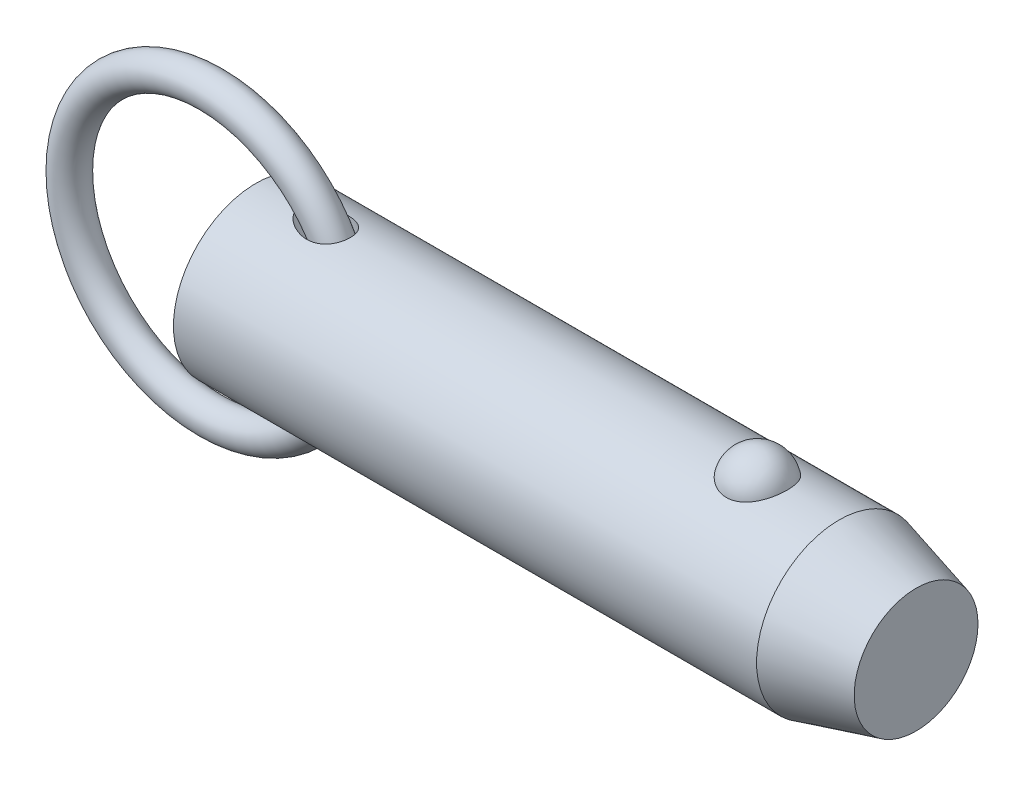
ISO-10303-21;
HEADER;
FILE_DESCRIPTION(('STEP AP214'),'2;1');
FILE_NAME('part.step','',(''),(''),'','','');
FILE_SCHEMA(('AUTOMOTIVE_DESIGN { 1 0 10303 214 1 1 1 1 }'));
ENDSEC;
DATA;
#1=APPLICATION_CONTEXT('core data for automotive mechanical design processes');
#2=APPLICATION_PROTOCOL_DEFINITION('international standard','automotive_design',2000,#1);
#3=PRODUCT_CONTEXT('',#1,'mechanical');
#4=PRODUCT('Part','Part','',(#3));
#5=PRODUCT_RELATED_PRODUCT_CATEGORY('part','',(#4));
#6=PRODUCT_DEFINITION_FORMATION('','',#4);
#7=PRODUCT_DEFINITION_CONTEXT('part definition',#1,'design');
#8=PRODUCT_DEFINITION('design','',#6,#7);
#9=PRODUCT_DEFINITION_SHAPE('','',#8);
#10=(LENGTH_UNIT() NAMED_UNIT(*) SI_UNIT(.MILLI.,.METRE.));
#11=(NAMED_UNIT(*) PLANE_ANGLE_UNIT() SI_UNIT($,.RADIAN.));
#12=(NAMED_UNIT(*) SI_UNIT($,.STERADIAN.) SOLID_ANGLE_UNIT());
#13=UNCERTAINTY_MEASURE_WITH_UNIT(LENGTH_MEASURE(1.E-05),#10,'distance_accuracy_value','');
#14=(GEOMETRIC_REPRESENTATION_CONTEXT(3) GLOBAL_UNCERTAINTY_ASSIGNED_CONTEXT((#13)) GLOBAL_UNIT_ASSIGNED_CONTEXT((#10,
#11,#12)) REPRESENTATION_CONTEXT('',''));
#15=CARTESIAN_POINT('',(0.,0.,0.));
#16=DIRECTION('',(0.,0.,1.));
#17=DIRECTION('',(1.,0.,0.));
#18=AXIS2_PLACEMENT_3D('',#15,#16,#17);
#19=CARTESIAN_POINT('',(-6.08699288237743,0.,0.));
#20=DIRECTION('',(0.,0.,1.));
#21=DIRECTION('',(1.,0.,0.));
#22=AXIS2_PLACEMENT_3D('',#19,#20,#21);
#23=TOROIDAL_SURFACE('',#22,19.05,2.223);
#24=CARTESIAN_POINT('',(15.1860071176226,0.,0.));
#25=VERTEX_POINT('',#24);
#26=VERTEX_LOOP('',#25);
#27=FACE_BOUND('',#26,.T.);
#28=ADVANCED_FACE('P0_F12',(#27),#23,.T.);
#29=CLOSED_SHELL('',(#28));
#30=MANIFOLD_SOLID_BREP('P0_B1',#29);
#31=CARTESIAN_POINT('',(0.,0.,0.));
#32=DIRECTION('',(1.,0.,0.));
#33=DIRECTION('',(0.,0.,-1.));
#34=AXIS2_PLACEMENT_3D('',#31,#32,#33);
#35=CYLINDRICAL_SURFACE('',#34,11.115);
#36=CARTESIAN_POINT('',(6.41405181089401,11.0227946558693,-1.4287136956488));
#37=CARTESIAN_POINT('',(6.49338916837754,11.0115377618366,-1.51556642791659));
#38=CARTESIAN_POINT('',(6.57765461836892,10.9998263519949,-1.59789397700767));
#39=CARTESIAN_POINT('',(6.75386647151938,10.9760304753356,-1.75391400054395));
#40=CARTESIAN_POINT('',(6.84582247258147,10.9639455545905,-1.82759540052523));
#41=CARTESIAN_POINT('',(7.03627827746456,10.9397989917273,-1.96698954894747));
#42=CARTESIAN_POINT('',(7.13480838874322,10.9277377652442,-2.03266078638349));
#43=CARTESIAN_POINT('',(7.33681032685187,10.9041015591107,-2.1558582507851));
#44=CARTESIAN_POINT('',(7.44028007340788,10.8925263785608,-2.21338786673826));
#45=CARTESIAN_POINT('',(7.64386117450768,10.8710104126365,-2.31666528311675));
#46=CARTESIAN_POINT('',(7.74368989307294,10.8610119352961,-2.36295942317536));
#47=CARTESIAN_POINT('',(7.94637195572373,10.8420168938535,-2.44863486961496));
#48=CARTESIAN_POINT('',(8.04922612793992,10.8330206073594,-2.48801426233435));
#49=CARTESIAN_POINT('',(8.36115573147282,10.807980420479,-2.59542730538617));
#50=CARTESIAN_POINT('',(8.57411849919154,10.7938278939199,-2.65299817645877));
#51=CARTESIAN_POINT('',(9.00825016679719,10.7725818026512,-2.73800108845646));
#52=CARTESIAN_POINT('',(9.22947335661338,10.7655491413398,-2.76517330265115));
#53=CARTESIAN_POINT('',(9.67368141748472,10.7605872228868,-2.78445308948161));
#54=CARTESIAN_POINT('',(9.89666486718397,10.7626512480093,-2.77658653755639));
#55=CARTESIAN_POINT('',(10.2950172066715,10.7754452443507,-2.72644436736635));
#56=CARTESIAN_POINT('',(10.4712789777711,10.7844280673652,-2.69109376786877));
#57=CARTESIAN_POINT('',(10.7292776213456,10.8024982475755,-2.61722365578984));
#58=CARTESIAN_POINT('',(10.8142337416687,10.8092901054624,-2.58911576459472));
#59=CARTESIAN_POINT('',(10.9813218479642,10.8242580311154,-2.52581287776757));
#60=CARTESIAN_POINT('',(11.0634550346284,10.8324335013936,-2.49062094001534));
#61=CARTESIAN_POINT('',(11.2247418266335,10.8500287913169,-2.41281958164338));
#62=CARTESIAN_POINT('',(11.3038694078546,10.8594572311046,-2.37015806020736));
#63=CARTESIAN_POINT('',(11.4576781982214,10.8792243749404,-2.27770403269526));
#64=CARTESIAN_POINT('',(11.5323615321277,10.8895626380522,-2.22791497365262));
#65=CARTESIAN_POINT('',(11.6765388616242,10.9108113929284,-2.12140590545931));
#66=CARTESIAN_POINT('',(11.7460329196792,10.9217218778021,-2.06468597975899));
#67=CARTESIAN_POINT('',(11.8790597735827,10.9437207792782,-1.94471764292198));
#68=CARTESIAN_POINT('',(11.9425932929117,10.9548091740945,-1.88147002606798));
#69=CARTESIAN_POINT('',(12.109388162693,10.9851999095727,-1.69784918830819));
#70=CARTESIAN_POINT('',(12.205655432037,11.0042655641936,-1.57093023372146));
#71=CARTESIAN_POINT('',(12.374151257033,11.0393391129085,-1.3017676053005));
#72=CARTESIAN_POINT('',(12.4463875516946,11.0553479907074,-1.15952888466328));
#73=CARTESIAN_POINT('',(12.5615818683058,11.0816338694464,-0.871972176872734));
#74=CARTESIAN_POINT('',(12.6058896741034,11.0921698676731,-0.727217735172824));
#75=CARTESIAN_POINT('',(12.6699315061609,11.1075802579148,-0.432089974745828));
#76=CARTESIAN_POINT('',(12.6896681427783,11.1124552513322,-0.281717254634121));
#77=CARTESIAN_POINT('',(12.7040225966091,11.1159901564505,0.0188164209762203));
#78=CARTESIAN_POINT('',(12.6988836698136,11.1147102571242,0.168965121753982));
#79=CARTESIAN_POINT('',(12.6641681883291,11.1062126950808,0.466238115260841));
#80=CARTESIAN_POINT('',(12.6345920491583,11.0989951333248,0.61336245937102));
#81=CARTESIAN_POINT('',(12.5517453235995,11.0794095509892,0.900330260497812));
#82=CARTESIAN_POINT('',(12.4984878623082,11.0670443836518,1.0401777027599));
#83=CARTESIAN_POINT('',(12.3696588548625,11.0385082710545,1.308745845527));
#84=CARTESIAN_POINT('',(12.2940887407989,11.0223375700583,1.43746725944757));
#85=CARTESIAN_POINT('',(12.122380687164,10.987872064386,1.68079704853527));
#86=CARTESIAN_POINT('',(12.0261637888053,10.969569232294,1.79534850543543));
#87=CARTESIAN_POINT('',(11.8161707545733,10.932836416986,2.00695695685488));
#88=CARTESIAN_POINT('',(11.7023941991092,10.9144064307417,2.10401353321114));
#89=CARTESIAN_POINT('',(11.4575656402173,10.8788057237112,2.28105326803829));
#90=CARTESIAN_POINT('',(11.3261451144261,10.8616794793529,2.36053412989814));
#91=CARTESIAN_POINT('',(11.0523589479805,10.8308019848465,2.49839044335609));
#92=CARTESIAN_POINT('',(10.9099908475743,10.8170514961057,2.55676113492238));
#93=CARTESIAN_POINT('',(10.6060622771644,10.7929728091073,2.65666105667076));
#94=CARTESIAN_POINT('',(10.4438877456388,10.7830209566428,2.69640163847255));
#95=CARTESIAN_POINT('',(10.1154037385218,10.7687230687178,2.75293129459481));
#96=CARTESIAN_POINT('',(9.94909141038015,10.7643810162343,2.76970406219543));
#97=CARTESIAN_POINT('',(9.54387061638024,10.7604809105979,2.7848723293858));
#98=CARTESIAN_POINT('',(9.30446860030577,10.7637793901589,2.77227753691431));
#99=CARTESIAN_POINT('',(8.94961255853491,10.7757341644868,2.72524141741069));
#100=CARTESIAN_POINT('',(8.83186896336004,10.7808994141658,2.70482239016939));
#101=CARTESIAN_POINT('',(8.59835142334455,10.7932548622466,2.6550999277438));
#102=CARTESIAN_POINT('',(8.48257728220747,10.8004448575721,2.62579738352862));
#103=CARTESIAN_POINT('',(8.25208469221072,10.8166382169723,2.55827624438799));
#104=CARTESIAN_POINT('',(8.13740214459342,10.8256649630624,2.51994155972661));
#105=CARTESIAN_POINT('',(7.91132058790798,10.8451170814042,2.43486475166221));
#106=CARTESIAN_POINT('',(7.79992154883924,10.8555424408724,2.38812270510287));
#107=CARTESIAN_POINT('',(7.58115677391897,10.8774251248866,2.28638483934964));
#108=CARTESIAN_POINT('',(7.47378802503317,10.8888816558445,2.23139534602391));
#109=CARTESIAN_POINT('',(7.26385624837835,10.9124540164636,2.1131026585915));
#110=CARTESIAN_POINT('',(7.1612916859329,10.9245696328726,2.04980214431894));
#111=CARTESIAN_POINT('',(6.91882218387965,10.9543689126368,1.88540538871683));
#112=CARTESIAN_POINT('',(6.78193778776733,10.9721958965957,1.77979827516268));
#113=CARTESIAN_POINT('',(6.5247244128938,11.0070222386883,1.54989693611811));
#114=CARTESIAN_POINT('',(6.40436902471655,11.0240228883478,1.42563320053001));
#115=CARTESIAN_POINT('',(6.21838804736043,11.0509658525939,1.19529359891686));
#116=CARTESIAN_POINT('',(6.14691885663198,11.0615430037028,1.09404520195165));
#117=CARTESIAN_POINT('',(6.02043496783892,11.0805004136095,0.881508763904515));
#118=CARTESIAN_POINT('',(5.96539400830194,11.0888841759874,0.770237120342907));
#119=CARTESIAN_POINT('',(5.88475453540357,11.1012553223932,0.560577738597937));
#120=CARTESIAN_POINT('',(5.85559643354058,11.1057686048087,0.463603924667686));
#121=CARTESIAN_POINT('',(5.81381299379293,11.1122523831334,0.266083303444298));
#122=CARTESIAN_POINT('',(5.80117118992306,11.1142254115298,0.165540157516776));
#123=CARTESIAN_POINT('',(5.79363815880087,11.1153999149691,-0.0364747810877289));
#124=CARTESIAN_POINT('',(5.79878799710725,11.1145949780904,-0.137948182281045));
#125=CARTESIAN_POINT('',(5.82639592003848,11.1102987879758,-0.338493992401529));
#126=CARTESIAN_POINT('',(5.84887234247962,11.1068046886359,-0.43756374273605));
#127=CARTESIAN_POINT('',(5.91510741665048,11.0965857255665,-0.649968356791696));
#128=CARTESIAN_POINT('',(5.96220905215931,11.0893566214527,-0.762222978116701));
#129=CARTESIAN_POINT('',(6.07378449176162,11.072471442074,-0.977396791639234));
#130=CARTESIAN_POINT('',(6.13826787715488,11.0628140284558,-1.08031079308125));
#131=CARTESIAN_POINT('',(6.2410107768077,11.0477136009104,-1.2219580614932));
#132=CARTESIAN_POINT('',(6.27403486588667,11.042895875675,-1.26469183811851));
#133=CARTESIAN_POINT('',(6.34238022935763,11.0330152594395,-1.34817011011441));
#134=CARTESIAN_POINT('',(6.37769867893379,11.0279526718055,-1.38891694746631));
#135=CARTESIAN_POINT('',(6.41405181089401,11.0227946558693,-1.4287136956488));
#136=B_SPLINE_CURVE_WITH_KNOTS('',3,(#36,#37,#38,#39,#40,#41,#42,#43,#44,#45,#46,#47,#48,#49,
#50,#51,#52,#53,#54,#55,#56,#57,#58,#59,#60,#61,#62,#63,#64,#65,#66,#67,#68,#69,#70,#71,#72,#73,
#74,#75,#76,#77,#78,#79,#80,#81,#82,#83,#84,#85,#86,#87,#88,#89,#90,#91,#92,#93,#94,#95,#96,#97,
#98,#99,#100,#101,#102,#103,#104,#105,#106,#107,#108,#109,#110,#111,#112,#113,#114,#115,#116,
#117,#118,#119,#120,#121,#122,#123,#124,#125,#126,#127,#128,#129,#130,#131,#132,#133,#134,#135),
.UNSPECIFIED.,.T.,.F.,(4,2,2,2,2,2,2,2,2,2,2,2,2,2,2,2,2,2,2,2,2,2,2,2,2,2,2,2,2,2,2,2,2,2,2,2,
2,2,2,2,2,2,2,2,2,2,2,2,2,4),(0.,0.35443329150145,0.709315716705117,1.0659654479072,
1.42246628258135,1.7536715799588,2.08496839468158,2.74582009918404,3.41227815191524,
4.07824412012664,4.61583787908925,4.88478112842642,5.1536085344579,5.42439170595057,
5.69504436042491,5.96569375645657,6.23631025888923,6.71490729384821,7.19335005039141,
7.64641437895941,8.09943057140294,8.54802575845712,8.99661331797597,9.44495256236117,
9.89326303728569,10.3433195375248,10.7933867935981,11.2550086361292,11.7167345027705,
12.2165866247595,12.7167934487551,13.4318876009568,13.7904664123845,14.1490092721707,
14.5124394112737,14.8758662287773,15.239015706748,15.6020483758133,16.1219860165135,
16.6410830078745,17.0130520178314,17.3844231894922,17.6872330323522,17.9897407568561,
18.2929471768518,18.5964749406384,18.9603532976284,19.3244326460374,19.4870338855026,
19.649438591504),.UNSPECIFIED.);
#137=CARTESIAN_POINT('',(6.41405181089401,11.0227946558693,-1.4287136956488));
#138=VERTEX_POINT('',#137);
#139=EDGE_CURVE('P1_E40',#138,#138,#136,.T.);
#140=ORIENTED_EDGE('',*,*,#139,.T.);
#141=EDGE_LOOP('',(#140));
#142=FACE_BOUND('',#141,.T.);
#143=CARTESIAN_POINT('',(78.529563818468,0.,0.));
#144=DIRECTION('',(1.,0.,0.));
#145=DIRECTION('',(0.,0.,-1.));
#146=AXIS2_PLACEMENT_3D('',#143,#144,#145);
#147=CIRCLE('',#146,11.115);
#148=CARTESIAN_POINT('',(78.529563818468,0.,-11.115));
#149=VERTEX_POINT('',#148);
#150=EDGE_CURVE('P1_E25',#149,#149,#147,.T.);
#151=ORIENTED_EDGE('',*,*,#150,.F.);
#152=EDGE_LOOP('',(#151));
#153=FACE_BOUND('',#152,.T.);
#154=CARTESIAN_POINT('',(0.,0.,0.));
#155=DIRECTION('',(1.,0.,0.));
#156=DIRECTION('',(0.,0.,-1.));
#157=AXIS2_PLACEMENT_3D('',#154,#155,#156);
#158=CIRCLE('',#157,11.115);
#159=CARTESIAN_POINT('',(0.,0.,-11.115));
#160=VERTEX_POINT('',#159);
#161=EDGE_CURVE('P1_E9',#160,#160,#158,.T.);
#162=ORIENTED_EDGE('',*,*,#161,.T.);
#163=EDGE_LOOP('',(#162));
#164=FACE_BOUND('',#163,.T.);
#165=CARTESIAN_POINT('',(67.5310680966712,10.3028087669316,4.17077409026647));
#166=CARTESIAN_POINT('',(67.3147756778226,10.3028003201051,4.17078240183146));
#167=CARTESIAN_POINT('',(67.0985488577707,10.3098895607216,4.15340593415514));
#168=CARTESIAN_POINT('',(66.6725408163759,10.3373834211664,4.08449540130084));
#169=CARTESIAN_POINT('',(66.4627577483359,10.3577841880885,4.03297121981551));
#170=CARTESIAN_POINT('',(66.0557825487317,10.4095237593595,3.89746513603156));
#171=CARTESIAN_POINT('',(65.8585726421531,10.4408466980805,3.81353029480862));
#172=CARTESIAN_POINT('',(65.4813382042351,10.5110236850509,3.61560339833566));
#173=CARTESIAN_POINT('',(65.3013171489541,10.5498792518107,3.50160528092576));
#174=CARTESIAN_POINT('',(64.9576842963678,10.6322884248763,3.24292464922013));
#175=CARTESIAN_POINT('',(64.7946861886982,10.6759443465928,3.09746040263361));
#176=CARTESIAN_POINT('',(64.4945911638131,10.7625291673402,2.78171925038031));
#177=CARTESIAN_POINT('',(64.3574990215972,10.8054579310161,2.61143778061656));
#178=CARTESIAN_POINT('',(64.1064084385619,10.8881935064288,2.24226695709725));
#179=CARTESIAN_POINT('',(63.9937105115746,10.9277761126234,2.04244123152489));
#180=CARTESIAN_POINT('',(63.8017771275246,10.997484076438,1.62578254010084));
#181=CARTESIAN_POINT('',(63.722544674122,11.0276085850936,1.40894804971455));
#182=CARTESIAN_POINT('',(63.5983034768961,11.0756732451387,0.961250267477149));
#183=CARTESIAN_POINT('',(63.553760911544,11.0934470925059,0.730239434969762));
#184=CARTESIAN_POINT('',(63.5015695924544,11.1143331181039,0.263439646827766));
#185=CARTESIAN_POINT('',(63.4939200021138,11.1174456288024,0.0276507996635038));
#186=CARTESIAN_POINT('',(63.5156105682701,11.1087161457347,-0.440729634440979));
#187=CARTESIAN_POINT('',(63.5447624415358,11.0969502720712,-0.673331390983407));
#188=CARTESIAN_POINT('',(63.6391432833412,11.0597872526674,-1.12996621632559));
#189=CARTESIAN_POINT('',(63.7043729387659,11.0343898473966,-1.35399912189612));
#190=CARTESIAN_POINT('',(63.8696984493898,10.972515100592,-1.78750286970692));
#191=CARTESIAN_POINT('',(63.9698386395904,10.9360236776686,-1.99695478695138));
#192=CARTESIAN_POINT('',(64.2029408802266,10.8557595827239,-2.39520667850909));
#193=CARTESIAN_POINT('',(64.3359054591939,10.8119863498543,-2.5840050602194));
#194=CARTESIAN_POINT('',(64.632407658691,10.7216733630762,-2.93635726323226));
#195=CARTESIAN_POINT('',(64.7960565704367,10.675123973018,-3.09981510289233));
#196=CARTESIAN_POINT('',(65.1498601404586,10.5846571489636,-3.39592247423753));
#197=CARTESIAN_POINT('',(65.3400123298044,10.5407394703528,-3.52857487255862));
#198=CARTESIAN_POINT('',(65.7375014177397,10.4616690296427,-3.75646057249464));
#199=CARTESIAN_POINT('',(65.9443670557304,10.4263443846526,-3.85245432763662));
#200=CARTESIAN_POINT('',(66.3729541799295,10.3675574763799,-4.0079874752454));
#201=CARTESIAN_POINT('',(66.594670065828,10.3440907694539,-4.06754052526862));
#202=CARTESIAN_POINT('',(67.0346695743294,10.3128282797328,-4.14614314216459));
#203=CARTESIAN_POINT('',(67.2525654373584,10.3043040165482,-4.16707833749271));
#204=CARTESIAN_POINT('',(67.68894951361,10.3016771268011,-4.17357158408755));
#205=CARTESIAN_POINT('',(67.9074376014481,10.3075716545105,-4.15913661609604));
#206=CARTESIAN_POINT('',(68.3317442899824,10.3326686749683,-4.09636961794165));
#207=CARTESIAN_POINT('',(68.5377458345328,10.3514555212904,-4.04909574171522));
#208=CARTESIAN_POINT('',(68.9385764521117,10.3998183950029,-3.92320197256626));
#209=CARTESIAN_POINT('',(69.1334046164,10.4293952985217,-3.84457953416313));
#210=CARTESIAN_POINT('',(69.5111917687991,10.4969600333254,-3.65612410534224));
#211=CARTESIAN_POINT('',(69.6937974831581,10.5351178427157,-3.5456454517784));
#212=CARTESIAN_POINT('',(70.0382040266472,10.6154999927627,-3.29718036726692));
#213=CARTESIAN_POINT('',(70.200000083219,10.657725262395,-3.15918764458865));
#214=CARTESIAN_POINT('',(70.5069596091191,10.744212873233,-2.85163580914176));
#215=CARTESIAN_POINT('',(70.6508919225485,10.7884718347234,-2.68084605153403));
#216=CARTESIAN_POINT('',(70.9092371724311,10.872374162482,-2.31721864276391));
#217=CARTESIAN_POINT('',(71.0236448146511,10.9120167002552,-2.12437704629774));
#218=CARTESIAN_POINT('',(71.2238739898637,10.9838919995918,-1.71516999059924));
#219=CARTESIAN_POINT('',(71.3086617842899,11.0158465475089,-1.49824866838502));
#220=CARTESIAN_POINT('',(71.4426838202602,11.0673523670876,-1.05228572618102));
#221=CARTESIAN_POINT('',(71.4919174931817,11.086903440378,-0.823243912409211));
#222=CARTESIAN_POINT('',(71.5538915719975,11.1116323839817,-0.359087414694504));
#223=CARTESIAN_POINT('',(71.5665662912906,11.1167843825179,-0.123962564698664));
#224=CARTESIAN_POINT('',(71.554973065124,11.1121144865,0.345220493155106));
#225=CARTESIAN_POINT('',(71.5307056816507,11.1022928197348,0.579278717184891));
#226=CARTESIAN_POINT('',(71.4459073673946,11.0687504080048,1.03866534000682));
#227=CARTESIAN_POINT('',(71.3855299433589,11.0450885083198,1.26402641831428));
#228=CARTESIAN_POINT('',(71.2298532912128,10.9863185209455,1.70076772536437));
#229=CARTESIAN_POINT('',(71.134551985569,10.9512097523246,1.91214712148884));
#230=CARTESIAN_POINT('',(70.9103974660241,10.8729733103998,2.316083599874));
#231=CARTESIAN_POINT('',(70.7813806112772,10.8298068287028,2.50854240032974));
#232=CARTESIAN_POINT('',(70.4927327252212,10.7401896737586,2.86808766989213));
#233=CARTESIAN_POINT('',(70.3331022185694,10.6937390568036,3.03517457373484));
#234=CARTESIAN_POINT('',(69.9875341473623,10.6029321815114,3.33857581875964));
#235=CARTESIAN_POINT('',(69.8017089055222,10.5585680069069,3.47501541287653));
#236=CARTESIAN_POINT('',(69.4078750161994,10.4769321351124,3.71390897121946));
#237=CARTESIAN_POINT('',(69.1998635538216,10.439661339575,3.81635861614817));
#238=CARTESIAN_POINT('',(68.7540666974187,10.3749407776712,3.98910631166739));
#239=CARTESIAN_POINT('',(68.5152342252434,10.3482457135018,4.05700929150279));
#240=CARTESIAN_POINT('',(68.0279254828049,10.312188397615,4.14782844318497));
#241=CARTESIAN_POINT('',(67.7794535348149,10.3028184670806,4.17076454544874));
#242=CARTESIAN_POINT('',(67.5310680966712,10.3028087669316,4.17077409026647));
#243=B_SPLINE_CURVE_WITH_KNOTS('',3,(#165,#166,#167,#168,#169,#170,#171,#172,#173,#174,#175,
#176,#177,#178,#179,#180,#181,#182,#183,#184,#185,#186,#187,#188,#189,#190,#191,#192,#193,#194,
#195,#196,#197,#198,#199,#200,#201,#202,#203,#204,#205,#206,#207,#208,#209,#210,#211,#212,#213,
#214,#215,#216,#217,#218,#219,#220,#221,#222,#223,#224,#225,#226,#227,#228,#229,#230,#231,#232,
#233,#234,#235,#236,#237,#238,#239,#240,#241,#242),.UNSPECIFIED.,.T.,.F.,(4,2,2,2,2,2,2,2,2,2,2,
2,2,2,2,2,2,2,2,2,2,2,2,2,2,2,2,2,2,2,2,2,2,2,2,2,2,2,4),(0.,0.647966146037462,1.29574482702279,
1.94258643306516,2.58955857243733,3.25496465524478,3.92049326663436,4.61566368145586,
5.31089647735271,6.0153182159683,6.71972398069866,7.42054043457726,8.12137023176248,
8.82309331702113,9.52487047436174,10.2292439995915,10.9335519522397,11.622333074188,
12.3108558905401,12.9647664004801,13.6185478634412,14.2521847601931,14.8858731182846,
15.5334360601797,16.1811472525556,16.8611459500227,17.5412664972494,18.2431855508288,
18.9451158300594,19.6483065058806,20.3514864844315,21.0516982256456,21.7519516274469,
22.4556690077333,23.1593743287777,23.8601491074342,24.5610129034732,25.3054529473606,
26.0495629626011),.UNSPECIFIED.);
#244=CARTESIAN_POINT('',(67.5310680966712,10.3028087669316,4.17077409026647));
#245=VERTEX_POINT('',#244);
#246=EDGE_CURVE('P1_E34',#245,#245,#243,.T.);
#247=ORIENTED_EDGE('',*,*,#246,.T.);
#248=EDGE_LOOP('',(#247));
#249=FACE_BOUND('',#248,.T.);
#250=CARTESIAN_POINT('',(6.41405181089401,-11.0227946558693,-1.4287136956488));
#251=CARTESIAN_POINT('',(6.33124061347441,-11.0345445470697,-1.33806125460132));
#252=CARTESIAN_POINT('',(6.25372866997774,-11.0458090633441,-1.24240732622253));
#253=CARTESIAN_POINT('',(6.11277905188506,-11.0666115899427,-1.04095704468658));
#254=CARTESIAN_POINT('',(6.0493392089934,-11.0761498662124,-0.935162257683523));
#255=CARTESIAN_POINT('',(5.94029181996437,-11.0927063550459,-0.712476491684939));
#256=CARTESIAN_POINT('',(5.89492964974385,-11.0996897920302,-0.595457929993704));
#257=CARTESIAN_POINT('',(5.8449816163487,-11.1074141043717,-0.414997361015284));
#258=CARTESIAN_POINT('',(5.83135004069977,-11.1095300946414,-0.354047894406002));
#259=CARTESIAN_POINT('',(5.81051649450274,-11.1127688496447,-0.231041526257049));
#260=CARTESIAN_POINT('',(5.80331311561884,-11.1138918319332,-0.1689848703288));
#261=CARTESIAN_POINT('',(5.79296529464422,-11.1155042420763,-0.00048481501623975));
#262=CARTESIAN_POINT('',(5.79625267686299,-11.1149904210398,0.106437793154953));
#263=CARTESIAN_POINT('',(5.82213676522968,-11.1109609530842,0.317809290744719));
#264=CARTESIAN_POINT('',(5.84474662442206,-11.1074432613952,0.422256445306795));
#265=CARTESIAN_POINT('',(5.91113114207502,-11.097197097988,0.63936180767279));
#266=CARTESIAN_POINT('',(5.95733120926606,-11.090102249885,0.751250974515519));
#267=CARTESIAN_POINT('',(6.0670954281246,-11.0734770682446,0.965912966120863));
#268=CARTESIAN_POINT('',(6.1306873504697,-11.06394284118,1.06867085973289));
#269=CARTESIAN_POINT('',(6.30294237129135,-11.0385920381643,1.30890635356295));
#270=CARTESIAN_POINT('',(6.41896200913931,-11.0218881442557,1.44097376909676));
#271=CARTESIAN_POINT('',(6.66989654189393,-10.9871512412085,1.68553954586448));
#272=CARTESIAN_POINT('',(6.80485520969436,-10.9691152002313,1.79799117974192));
#273=CARTESIAN_POINT('',(7.04881236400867,-10.9382283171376,1.97587596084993));
#274=CARTESIAN_POINT('',(7.15465712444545,-10.9253240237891,2.04570822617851));
#275=CARTESIAN_POINT('',(7.37202504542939,-10.9000987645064,2.17611840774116));
#276=CARTESIAN_POINT('',(7.48355057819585,-10.8877780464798,2.23669241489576));
#277=CARTESIAN_POINT('',(7.71132418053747,-10.8641580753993,2.34873831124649));
#278=CARTESIAN_POINT('',(7.82757727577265,-10.8528599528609,2.40020018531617));
#279=CARTESIAN_POINT('',(8.06386825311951,-10.8317234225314,2.49385169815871));
#280=CARTESIAN_POINT('',(8.18390558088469,-10.8218848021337,2.53604268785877));
#281=CARTESIAN_POINT('',(8.42918336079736,-10.8039208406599,2.61152283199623));
#282=CARTESIAN_POINT('',(8.55447802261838,-10.7958283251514,2.64464414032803));
#283=CARTESIAN_POINT('',(8.80752127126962,-10.781995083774,2.70048793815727));
#284=CARTESIAN_POINT('',(8.9352701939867,-10.7762546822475,2.72320899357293));
#285=CARTESIAN_POINT('',(9.19210176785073,-10.7675291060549,2.75750994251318));
#286=CARTESIAN_POINT('',(9.32118105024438,-10.7645381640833,2.76911315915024));
#287=CARTESIAN_POINT('',(9.57984338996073,-10.761622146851,2.78042035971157));
#288=CARTESIAN_POINT('',(9.70942621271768,-10.7616957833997,2.78012934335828));
#289=CARTESIAN_POINT('',(10.0243125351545,-10.7659059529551,2.76381534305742));
#290=CARTESIAN_POINT('',(10.209307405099,-10.7717977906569,2.74099674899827));
#291=CARTESIAN_POINT('',(10.5731188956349,-10.7905408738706,2.66626238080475));
#292=CARTESIAN_POINT('',(10.7519389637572,-10.8033881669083,2.61436313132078));
#293=CARTESIAN_POINT('',(11.0114289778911,-10.8271584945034,2.51336808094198));
#294=CARTESIAN_POINT('',(11.0968318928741,-10.835881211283,2.47562331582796));
#295=CARTESIAN_POINT('',(11.2636000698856,-10.8545688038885,2.39236170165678));
#296=CARTESIAN_POINT('',(11.344967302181,-10.8645330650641,2.3468486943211));
#297=CARTESIAN_POINT('',(11.5027832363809,-10.8853818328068,2.24815967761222));
#298=CARTESIAN_POINT('',(11.5792327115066,-10.8962661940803,2.19498487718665));
#299=CARTESIAN_POINT('',(11.7263315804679,-10.9185541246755,2.08128855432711));
#300=CARTESIAN_POINT('',(11.7969818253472,-10.9299576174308,2.02076811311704));
#301=CARTESIAN_POINT('',(11.9817953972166,-10.9613645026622,1.84513663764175));
#302=CARTESIAN_POINT('',(12.0893012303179,-10.9814643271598,1.72286660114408));
#303=CARTESIAN_POINT('',(12.2803576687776,-11.0193991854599,1.46066991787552));
#304=CARTESIAN_POINT('',(12.3639173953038,-11.0372350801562,1.32075002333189));
#305=CARTESIAN_POINT('',(12.4996220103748,-11.0672969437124,1.03778067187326));
#306=CARTESIAN_POINT('',(12.5535315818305,-11.0798242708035,0.895607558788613));
#307=CARTESIAN_POINT('',(12.636874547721,-11.0995427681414,0.603918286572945));
#308=CARTESIAN_POINT('',(12.6663115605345,-11.1067347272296,0.454403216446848));
#309=CARTESIAN_POINT('',(12.6997387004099,-11.1149224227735,0.154577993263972));
#310=CARTESIAN_POINT('',(12.7040886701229,-11.1160057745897,0.00431019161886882));
#311=CARTESIAN_POINT('',(12.6882048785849,-11.1120956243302,-0.294841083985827));
#312=CARTESIAN_POINT('',(12.6679715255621,-11.1071022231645,-0.44372458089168));
#313=CARTESIAN_POINT('',(12.6034470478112,-11.0915888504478,-0.735688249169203));
#314=CARTESIAN_POINT('',(12.5591858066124,-11.0810757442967,-0.878775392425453));
#315=CARTESIAN_POINT('',(12.4477416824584,-11.0556687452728,-1.15529525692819));
#316=CARTESIAN_POINT('',(12.3805601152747,-11.0407751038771,-1.2887285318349));
#317=CARTESIAN_POINT('',(12.2248919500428,-11.0081839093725,-1.54257976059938));
#318=CARTESIAN_POINT('',(12.1363549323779,-10.9904797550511,-1.66296592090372));
#319=CARTESIAN_POINT('',(11.9406137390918,-10.9541951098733,-1.88726577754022));
#320=CARTESIAN_POINT('',(11.833409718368,-10.9356146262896,-1.99117961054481));
#321=CARTESIAN_POINT('',(11.601318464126,-10.8991360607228,-2.18213646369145));
#322=CARTESIAN_POINT('',(11.4761325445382,-10.8812577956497,-2.26881927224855));
#323=CARTESIAN_POINT('',(11.2134852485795,-10.8482871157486,-2.42157282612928));
#324=CARTESIAN_POINT('',(11.0760218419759,-10.8331951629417,-2.48764015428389));
#325=CARTESIAN_POINT('',(10.7828968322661,-10.8061050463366,-2.60290068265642));
#326=CARTESIAN_POINT('',(10.6266338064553,-10.7943907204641,-2.65062248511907));
#327=CARTESIAN_POINT('',(10.3086617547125,-10.7762429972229,-2.72345054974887));
#328=CARTESIAN_POINT('',(10.146948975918,-10.7698133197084,-2.74854088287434));
#329=CARTESIAN_POINT('',(9.75541304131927,-10.7608036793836,-2.78368719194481));
#330=CARTESIAN_POINT('',(9.52459435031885,-10.7608467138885,-2.78350276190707));
#331=CARTESIAN_POINT('',(9.06604960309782,-10.7702674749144,-2.74677945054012));
#332=CARTESIAN_POINT('',(8.83832966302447,-10.7796615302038,-2.71017697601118));
#333=CARTESIAN_POINT('',(8.38783466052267,-10.8058248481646,-2.60392490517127));
#334=CARTESIAN_POINT('',(8.1651710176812,-10.8226939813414,-2.53382676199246));
#335=CARTESIAN_POINT('',(7.84087311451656,-10.8516548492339,-2.40555545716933));
#336=CARTESIAN_POINT('',(7.73435551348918,-10.8619221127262,-2.35892455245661));
#337=CARTESIAN_POINT('',(7.52510420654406,-10.883357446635,-2.25797017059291));
#338=CARTESIAN_POINT('',(7.4223698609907,-10.8945253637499,-2.20364800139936));
#339=CARTESIAN_POINT('',(7.23808758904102,-10.915528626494,-2.09688018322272));
#340=CARTESIAN_POINT('',(7.15584631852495,-10.9252787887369,-2.0456107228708));
#341=CARTESIAN_POINT('',(6.99510576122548,-10.944960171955,-1.93754729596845));
#342=CARTESIAN_POINT('',(6.91660574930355,-10.9548913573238,-1.88075440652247));
#343=CARTESIAN_POINT('',(6.76418133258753,-10.974690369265,-1.76154504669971));
#344=CARTESIAN_POINT('',(6.69024940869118,-10.9845582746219,-1.6991382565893));
#345=CARTESIAN_POINT('',(6.54780119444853,-11.0039826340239,-1.56842485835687));
#346=CARTESIAN_POINT('',(6.47928247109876,-11.0135392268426,-1.50012092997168));
#347=CARTESIAN_POINT('',(6.41405181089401,-11.0227946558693,-1.4287136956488));
#348=B_SPLINE_CURVE_WITH_KNOTS('',3,(#250,#251,#252,#253,#254,#255,#256,#257,#258,#259,#260,
#261,#262,#263,#264,#265,#266,#267,#268,#269,#270,#271,#272,#273,#274,#275,#276,#277,#278,#279,
#280,#281,#282,#283,#284,#285,#286,#287,#288,#289,#290,#291,#292,#293,#294,#295,#296,#297,#298,
#299,#300,#301,#302,#303,#304,#305,#306,#307,#308,#309,#310,#311,#312,#313,#314,#315,#316,#317,
#318,#319,#320,#321,#322,#323,#324,#325,#326,#327,#328,#329,#330,#331,#332,#333,#334,#335,#336,
#337,#338,#339,#340,#341,#342,#343,#344,#345,#346,#347),.UNSPECIFIED.,.T.,.F.,(4,2,2,2,2,2,2,2,
2,2,2,2,2,2,2,2,2,2,2,2,2,2,2,2,2,2,2,2,2,2,2,2,2,2,2,2,2,2,2,2,2,2,2,2,2,2,2,2,4),(0.,
0.36983565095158,0.739614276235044,1.1142538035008,1.30141910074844,1.48854338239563,
1.8074587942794,2.12659146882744,2.4883888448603,2.85076733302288,3.3776216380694,
3.90571433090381,4.287639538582,4.66972556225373,5.05222896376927,5.43467659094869,
5.82378546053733,6.21294796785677,6.6012922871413,6.98947336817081,7.54669558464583,
8.10360148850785,8.3845853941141,8.66543074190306,8.94623182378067,9.22699162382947,
9.7162888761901,10.2053995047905,10.6608871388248,11.1163074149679,11.5651786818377,
12.0140424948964,12.4623493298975,12.9106304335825,13.3599804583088,13.8093267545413,
14.2672570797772,14.7252632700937,15.214740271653,15.7045615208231,16.3932594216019,
17.083162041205,17.7825738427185,18.1325177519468,18.4824022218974,18.7744056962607,
19.0663523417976,19.3578048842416,19.6491256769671),.UNSPECIFIED.);
#349=CARTESIAN_POINT('',(6.41405181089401,-11.0227946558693,-1.4287136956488));
#350=VERTEX_POINT('',#349);
#351=EDGE_CURVE('P1_E17',#350,#350,#348,.T.);
#352=ORIENTED_EDGE('',*,*,#351,.T.);
#353=EDGE_LOOP('',(#352));
#354=FACE_BOUND('',#353,.T.);
#355=ADVANCED_FACE('P1_F13',(#142,#153,#164,#249,#354),#35,.T.);
#356=CARTESIAN_POINT('',(0.,0.,0.));
#357=DIRECTION('',(-1.,0.,0.));
#358=DIRECTION('',(0.,0.,1.));
#359=AXIS2_PLACEMENT_3D('',#356,#357,#358);
#360=PLANE('',#359);
#361=ORIENTED_EDGE('',*,*,#161,.F.);
#362=EDGE_LOOP('',(#361));
#363=FACE_BOUND('',#362,.T.);
#364=ADVANCED_FACE('P1_F15',(#363),#360,.T.);
#365=CARTESIAN_POINT('',(88.9,0.,0.));
#366=DIRECTION('',(-1.,0.,0.));
#367=DIRECTION('',(0.,0.,1.));
#368=AXIS2_PLACEMENT_3D('',#365,#366,#367);
#369=CONICAL_SURFACE('',#368,8.33625000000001,0.26179938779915);
#370=ORIENTED_EDGE('',*,*,#150,.T.);
#371=EDGE_LOOP('',(#370));
#372=FACE_BOUND('',#371,.T.);
#373=CARTESIAN_POINT('',(88.9,0.,0.));
#374=DIRECTION('',(1.,0.,0.));
#375=DIRECTION('',(0.,0.,-1.));
#376=AXIS2_PLACEMENT_3D('',#373,#374,#375);
#377=CIRCLE('',#376,8.33625000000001);
#378=CARTESIAN_POINT('',(88.9,0.,-8.33625000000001));
#379=VERTEX_POINT('',#378);
#380=EDGE_CURVE('P1_E30',#379,#379,#377,.T.);
#381=ORIENTED_EDGE('',*,*,#380,.F.);
#382=EDGE_LOOP('',(#381));
#383=FACE_BOUND('',#382,.T.);
#384=ADVANCED_FACE('P1_F55',(#372,#383),#369,.T.);
#385=CARTESIAN_POINT('',(88.9,8.33625000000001,0.));
#386=DIRECTION('',(1.,0.,0.));
#387=DIRECTION('',(0.,0.,-1.));
#388=AXIS2_PLACEMENT_3D('',#385,#386,#387);
#389=PLANE('',#388);
#390=ORIENTED_EDGE('',*,*,#380,.T.);
#391=EDGE_LOOP('',(#390));
#392=FACE_BOUND('',#391,.T.);
#393=ADVANCED_FACE('P1_F51',(#392),#389,.T.);
#394=CARTESIAN_POINT('',(67.5310680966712,10.0035,0.));
#395=DIRECTION('',(-1.,0.,0.));
#396=DIRECTION('',(0.,1.,0.));
#397=AXIS2_PLACEMENT_3D('',#394,#395,#396);
#398=SPHERICAL_SURFACE('',#397,4.18150000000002);
#399=ORIENTED_EDGE('',*,*,#246,.F.);
#400=EDGE_LOOP('',(#399));
#401=FACE_BOUND('',#400,.T.);
#402=ADVANCED_FACE('P1_F46',(#401),#398,.T.);
#403=CARTESIAN_POINT('',(-6.08699288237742,0.,0.));
#404=DIRECTION('',(0.,0.,1.));
#405=DIRECTION('',(1.,0.,0.));
#406=AXIS2_PLACEMENT_3D('',#403,#404,#405);
#407=TOROIDAL_SURFACE('',#406,19.05,2.77875);
#408=ORIENTED_EDGE('',*,*,#351,.F.);
#409=EDGE_LOOP('',(#408));
#410=FACE_BOUND('',#409,.T.);
#411=ORIENTED_EDGE('',*,*,#139,.F.);
#412=EDGE_LOOP('',(#411));
#413=FACE_BOUND('',#412,.T.);
#414=ADVANCED_FACE('P1_F50',(#410,#413),#407,.F.);
#415=CLOSED_SHELL('',(#355,#364,#384,#393,#402,#414));
#416=MANIFOLD_SOLID_BREP('P1_B1',#415);
#417=ADVANCED_BREP_SHAPE_REPRESENTATION('',(#18,#30,#416),#14);
#418=SHAPE_DEFINITION_REPRESENTATION(#9,#417);
ENDSEC;
END-ISO-10303-21;
